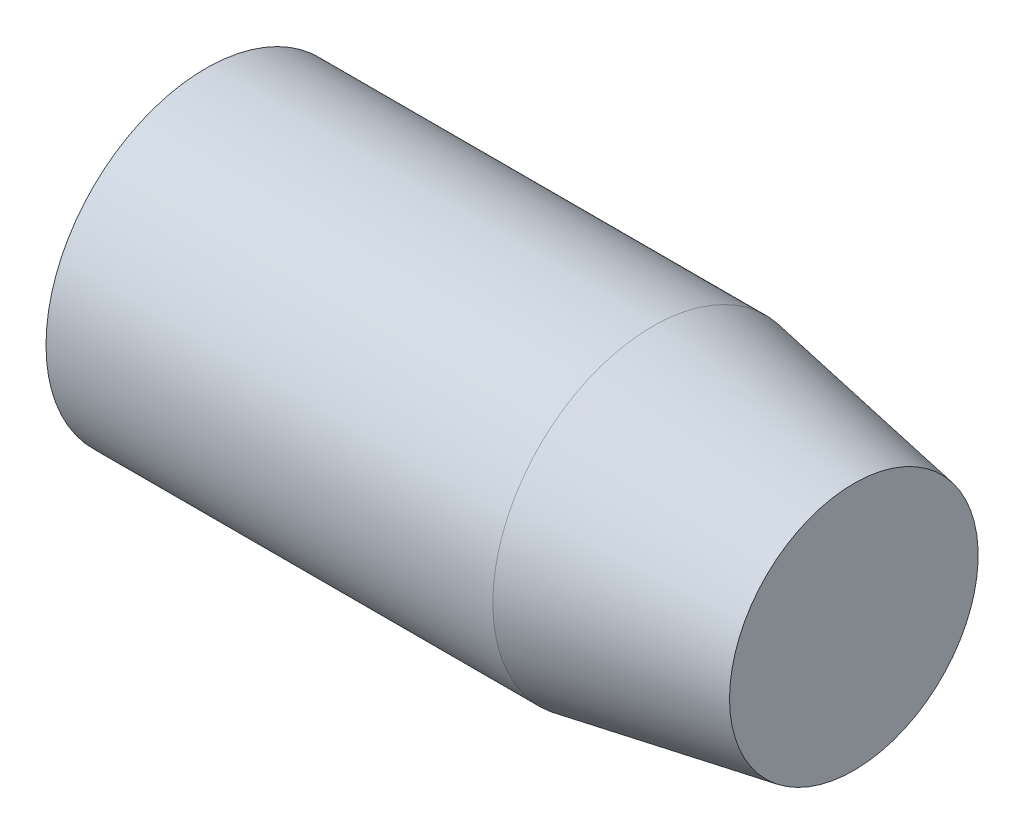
from build123d import *


with BuildPart() as part:
    # Sketch1 → Revolve1 (revolve)
    with BuildSketch(Plane.XY, mode=Mode.PRIVATE) as revolve1_sk:
        Polygon((0, 0), (4.826, 0), (4.826, 0.925751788), (3.32743063, 1.18999), (0, 1.18999), align=None)
    revolve(revolve1_sk.sketch.rotate(Axis((0, 0, 0), (1, 0, 0)), 90), axis=Axis((0, 0, 0), (1, 0, 0)))


solid = part.part
